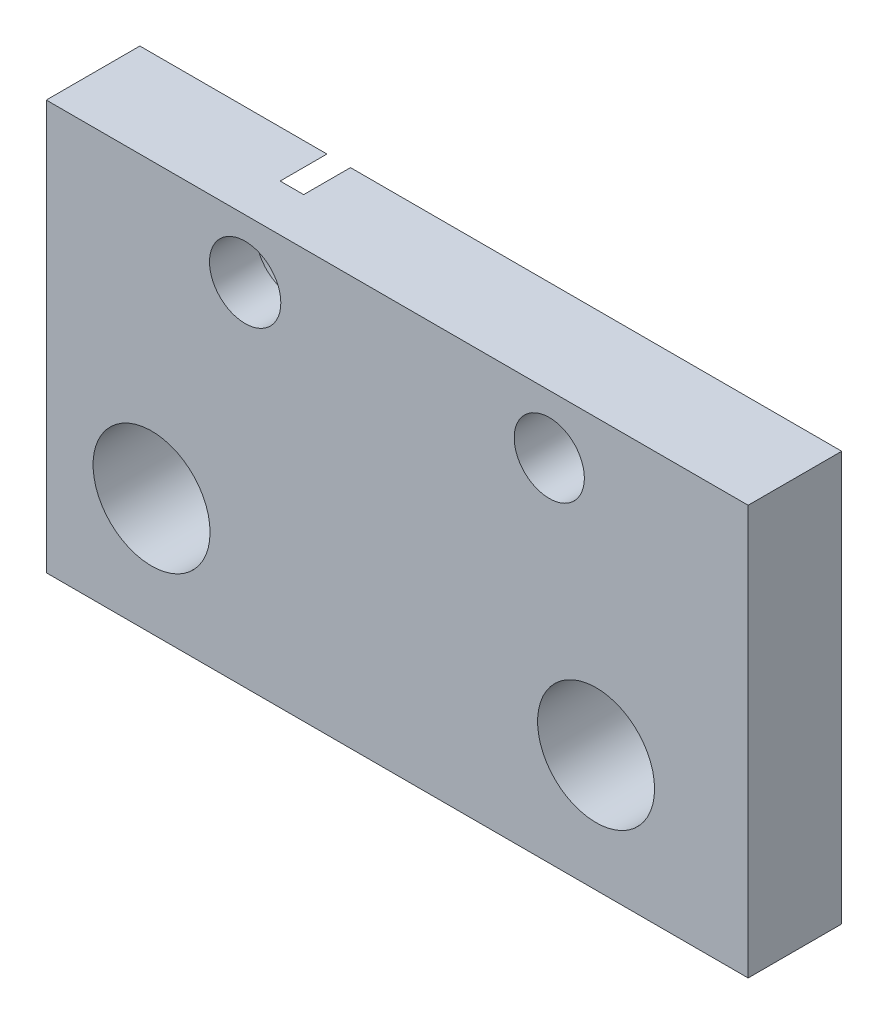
from build123d import *

# Parameters (mm, degrees)
ESQUISSE2_W             = 60
ESQUISSE2_H             = 35
BASE_EXTRUSION_DEPTH    = 8
ESQUISSE4_R             = 3.05
ESQUISSE4_R_2           = 3
ESQUISSE4_R_3           = 5
ENL_V_MAT_EXTRU_1_DEPTH = 8
ESQUISSE5_R             = 5.1
ENL_V_MAT_EXTRU_2_DEPTH = 4


with BuildPart() as part:
    # Esquisse2 → Base-Extrusion (new body)
    with BuildSketch(Plane.XY):
        with Locations((0, 7.5)):
            Rectangle(ESQUISSE2_W, ESQUISSE2_H)
    extrude(amount=BASE_EXTRUSION_DEPTH)

    # Esquisse4 → Enl_v. mat.-Extru.1 (cut)
    with BuildSketch(Plane.XY.offset(8)):
        with Locations((-13, 20)):
            Circle(ESQUISSE4_R)
        with Locations((13, 20)):
            Circle(ESQUISSE4_R_2)
        with Locations((-21, 0)):
            Circle(ESQUISSE4_R_3)
        with Locations((17, 0)):
            Circle(ESQUISSE4_R_3)
    extrude(amount=-ENL_V_MAT_EXTRU_1_DEPTH, mode=Mode.SUBTRACT)

    # Esquisse5 → Enl_v. mat.-Extru.2 (cut)
    with BuildSketch(Plane(origin=(0, 0, 0), x_dir=(-1, 0, 0), z_dir=(0, 0, -1))):
        with Locations((13, 20)):
            Circle(ESQUISSE5_R)
    extrude(amount=-ENL_V_MAT_EXTRU_2_DEPTH, mode=Mode.SUBTRACT)


solid = part.part
